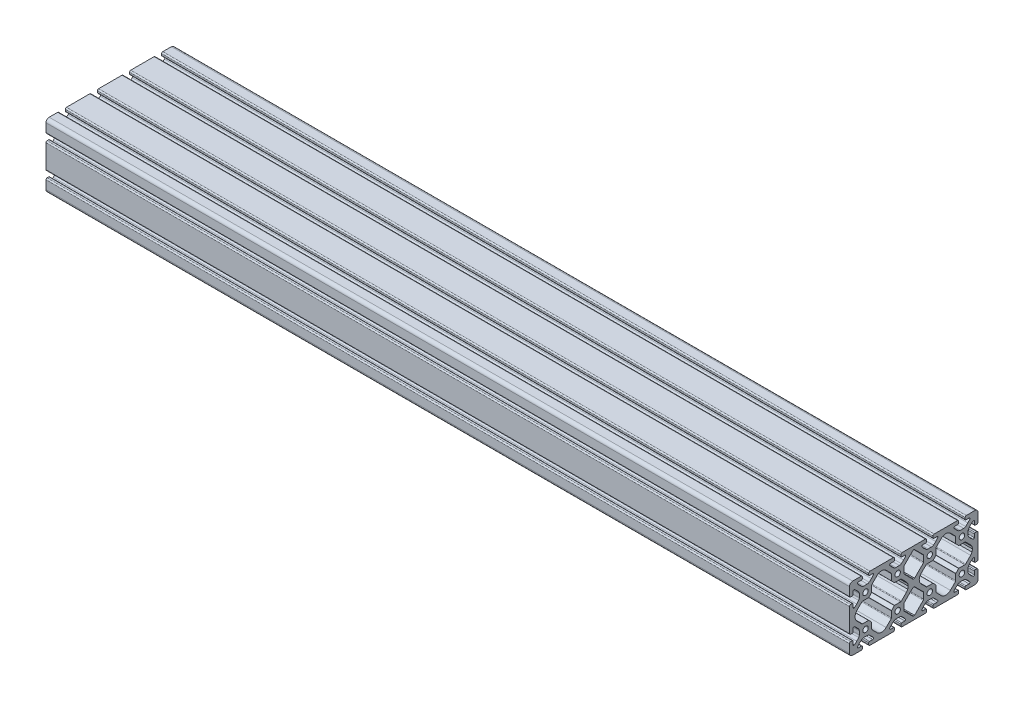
from build123d import *

# Parameters (mm, degrees)
MODEL_R                = 3.4
STRUKTURBAUTEIL1_DEPTH = 1000


with BuildPart() as part:
    # Model → Strukturbauteil1 (new body)
    with BuildSketch(Plane(origin=(0, 0, 0), x_dir=(0, 0, -1), z_dir=(1, 0, 0))):
        with BuildLine():
            Line((-73.773297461, 10.211192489), (-70.963551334, 12.621205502))
            Line((-70.963551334, 12.621205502), (-68.54047619, 15.419694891))
            ThreePointArc((-68.54047619, 15.419694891), (-67.952757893, 16.54958442), (-67.75, 17.806943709))
            Line((-67.75, 17.806943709), (-67.75, 22.193056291))
            ThreePointArc((-67.75, 22.193056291), (-67.952757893, 23.45041558), (-68.54047619, 24.580305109))
            Line((-68.54047619, 24.580305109), (-70.963551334, 27.378794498))
            Line((-70.963551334, 27.378794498), (-73.773297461, 29.788807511))
            ThreePointArc((-73.773297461, 29.788807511), (-74.905025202, 29.883468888), (-75.5, 28.91611505))
            Line((-75.5, 28.91611505), (-75.5, 25))
            ThreePointArc((-75.5, 25), (-75.792893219, 24.292893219), (-76.5, 24))
            Line((-76.5, 24), (-78.5, 24))
            ThreePointArc((-78.5, 24), (-79.560660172, 24.439339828), (-80, 25.5))
            Line((-80, 25.5), (-80, 36))
            ThreePointArc((-80, 36), (-78.828427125, 38.828427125), (-76, 40))
            Line((-76, 40), (-65.5, 40))
            ThreePointArc((-65.5, 40), (-64.439339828, 39.560660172), (-64, 38.5))
            Line((-64, 38.5), (-64, 36.5))
            ThreePointArc((-64, 36.5), (-64.292893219, 35.792893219), (-65, 35.5))
            Line((-65, 35.5), (-68.91611505, 35.5))
            ThreePointArc((-68.91611505, 35.5), (-69.883468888, 34.905025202), (-69.788807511, 33.773297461))
            Line((-69.788807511, 33.773297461), (-67.378794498, 30.963551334))
            Line((-67.378794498, 30.963551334), (-64.580305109, 28.54047619))
            ThreePointArc((-64.580305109, 28.54047619), (-63.45041558, 27.952757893), (-62.193056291, 27.75))
            Line((-62.193056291, 27.75), (-57.806943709, 27.75))
            ThreePointArc((-57.806943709, 27.75), (-56.54958442, 27.952757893), (-55.419694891, 28.54047619))
            Line((-55.419694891, 28.54047619), (-52.621205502, 30.963551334))
            Line((-52.621205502, 30.963551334), (-50.211192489, 33.773297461))
            ThreePointArc((-50.211192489, 33.773297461), (-50.116531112, 34.905025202), (-51.08388495, 35.5))
            Line((-51.08388495, 35.5), (-55, 35.5))
            ThreePointArc((-55, 35.5), (-55.707106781, 35.792893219), (-56, 36.5))
            Line((-56, 36.5), (-56, 38.5))
            ThreePointArc((-56, 38.5), (-55.560660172, 39.560660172), (-54.5, 40))
            Line((-54.5, 40), (-25.5, 40))
            ThreePointArc((-25.5, 40), (-24.439339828, 39.560660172), (-24, 38.5))
            Line((-24, 38.5), (-24, 36.5))
            ThreePointArc((-24, 36.5), (-24.292893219, 35.792893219), (-25, 35.5))
            Line((-25, 35.5), (-28.91611505, 35.5))
            ThreePointArc((-28.91611505, 35.5), (-29.883468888, 34.905025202), (-29.788807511, 33.773297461))
            Line((-29.788807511, 33.773297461), (-27.378794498, 30.963551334))
            Line((-27.378794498, 30.963551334), (-24.580305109, 28.54047619))
            ThreePointArc((-24.580305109, 28.54047619), (-23.45041558, 27.952757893), (-22.193056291, 27.75))
            Line((-22.193056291, 27.75), (-17.806943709, 27.75))
            ThreePointArc((-17.806943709, 27.75), (-16.54958442, 27.952757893), (-15.419694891, 28.54047619))
            Line((-15.419694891, 28.54047619), (-12.621205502, 30.963551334))
            Line((-12.621205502, 30.963551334), (-10.211192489, 33.773297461))
            ThreePointArc((-10.211192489, 33.773297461), (-10.116531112, 34.905025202), (-11.08388495, 35.5))
            Line((-11.08388495, 35.5), (-15, 35.5))
            ThreePointArc((-15, 35.5), (-15.707106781, 35.792893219), (-16, 36.5))
            Line((-16, 36.5), (-16, 38.5))
            ThreePointArc((-16, 38.5), (-15.560660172, 39.560660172), (-14.5, 40))
            Line((-14.5, 40), (14.5, 40))
            ThreePointArc((14.5, 40), (15.560660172, 39.560660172), (16, 38.5))
            Line((16, 38.5), (16, 36.5))
            ThreePointArc((16, 36.5), (15.707106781, 35.792893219), (15, 35.5))
            Line((15, 35.5), (11.08388495, 35.5))
            ThreePointArc((11.08388495, 35.5), (10.116531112, 34.905025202), (10.211192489, 33.773297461))
            Line((10.211192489, 33.773297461), (12.621205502, 30.963551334))
            Line((12.621205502, 30.963551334), (15.419694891, 28.54047619))
            ThreePointArc((15.419694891, 28.54047619), (16.54958442, 27.952757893), (17.806943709, 27.75))
            Line((17.806943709, 27.75), (22.193056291, 27.75))
            ThreePointArc((22.193056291, 27.75), (23.45041558, 27.952757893), (24.580305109, 28.54047619))
            Line((24.580305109, 28.54047619), (27.378794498, 30.963551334))
            Line((27.378794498, 30.963551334), (29.788807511, 33.773297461))
            ThreePointArc((29.788807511, 33.773297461), (29.883468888, 34.905025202), (28.91611505, 35.5))
            Line((28.91611505, 35.5), (25, 35.5))
            ThreePointArc((25, 35.5), (24.292893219, 35.792893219), (24, 36.5))
            Line((24, 36.5), (24, 38.5))
            ThreePointArc((24, 38.5), (24.439339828, 39.560660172), (25.5, 40))
            Line((25.5, 40), (54.5, 40))
            ThreePointArc((54.5, 40), (55.560660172, 39.560660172), (56, 38.5))
            Line((56, 38.5), (56, 36.5))
            ThreePointArc((56, 36.5), (55.707106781, 35.792893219), (55, 35.5))
            Line((55, 35.5), (51.08388495, 35.5))
            ThreePointArc((51.08388495, 35.5), (50.116531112, 34.905025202), (50.211192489, 33.773297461))
            Line((50.211192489, 33.773297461), (52.621205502, 30.963551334))
            Line((52.621205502, 30.963551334), (55.419694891, 28.54047619))
            ThreePointArc((55.419694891, 28.54047619), (56.54958442, 27.952757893), (57.806943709, 27.75))
            Line((57.806943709, 27.75), (62.193056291, 27.75))
            ThreePointArc((62.193056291, 27.75), (63.45041558, 27.952757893), (64.580305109, 28.54047619))
            Line((64.580305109, 28.54047619), (67.378794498, 30.963551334))
            Line((67.378794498, 30.963551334), (69.788807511, 33.773297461))
            ThreePointArc((69.788807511, 33.773297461), (69.883468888, 34.905025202), (68.91611505, 35.5))
            Line((68.91611505, 35.5), (65, 35.5))
            ThreePointArc((65, 35.5), (64.292893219, 35.792893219), (64, 36.5))
            Line((64, 36.5), (64, 38.5))
            ThreePointArc((64, 38.5), (64.439339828, 39.560660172), (65.5, 40))
            Line((65.5, 40), (76, 40))
            ThreePointArc((76, 40), (78.828427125, 38.828427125), (80, 36))
            Line((80, 36), (80, 25.5))
            ThreePointArc((80, 25.5), (79.560660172, 24.439339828), (78.5, 24))
            Line((78.5, 24), (76.5, 24))
            ThreePointArc((76.5, 24), (75.792893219, 24.292893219), (75.5, 25))
            Line((75.5, 25), (75.5, 28.91611505))
            ThreePointArc((75.5, 28.91611505), (74.905025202, 29.883468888), (73.773297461, 29.788807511))
            Line((73.773297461, 29.788807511), (70.963551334, 27.378794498))
            Line((70.963551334, 27.378794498), (68.54047619, 24.580305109))
            ThreePointArc((68.54047619, 24.580305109), (67.952757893, 23.45041558), (67.75, 22.193056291))
            Line((67.75, 22.193056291), (67.75, 17.806943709))
            ThreePointArc((67.75, 17.806943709), (67.952757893, 16.54958442), (68.54047619, 15.419694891))
            Line((68.54047619, 15.419694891), (70.963551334, 12.621205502))
            Line((70.963551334, 12.621205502), (73.773297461, 10.211192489))
            ThreePointArc((73.773297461, 10.211192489), (74.905025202, 10.116531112), (75.5, 11.08388495))
            Line((75.5, 11.08388495), (75.5, 15))
            ThreePointArc((75.5, 15), (75.792893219, 15.707106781), (76.5, 16))
            Line((76.5, 16), (78.5, 16))
            ThreePointArc((78.5, 16), (79.560660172, 15.560660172), (80, 14.5))
            Line((80, 14.5), (80, -14.5))
            ThreePointArc((80, -14.5), (79.560660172, -15.560660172), (78.5, -16))
            Line((78.5, -16), (76.5, -16))
            ThreePointArc((76.5, -16), (75.792893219, -15.707106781), (75.5, -15))
            Line((75.5, -15), (75.5, -11.08388495))
            ThreePointArc((75.5, -11.08388495), (74.905025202, -10.116531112), (73.773297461, -10.211192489))
            Line((73.773297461, -10.211192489), (70.963551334, -12.621205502))
            Line((70.963551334, -12.621205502), (68.54047619, -15.419694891))
            ThreePointArc((68.54047619, -15.419694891), (67.952757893, -16.54958442), (67.75, -17.806943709))
            Line((67.75, -17.806943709), (67.75, -22.193056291))
            ThreePointArc((67.75, -22.193056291), (67.952757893, -23.45041558), (68.54047619, -24.580305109))
            Line((68.54047619, -24.580305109), (70.963551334, -27.378794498))
            Line((70.963551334, -27.378794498), (73.773297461, -29.788807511))
            ThreePointArc((73.773297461, -29.788807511), (74.905025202, -29.883468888), (75.5, -28.91611505))
            Line((75.5, -28.91611505), (75.5, -25))
            ThreePointArc((75.5, -25), (75.792893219, -24.292893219), (76.5, -24))
            Line((76.5, -24), (78.5, -24))
            ThreePointArc((78.5, -24), (79.560660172, -24.439339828), (80, -25.5))
            Line((80, -25.5), (80, -36))
            ThreePointArc((80, -36), (78.828427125, -38.828427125), (76, -40))
            Line((76, -40), (65.5, -40))
            ThreePointArc((65.5, -40), (64.439339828, -39.560660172), (64, -38.5))
            Line((64, -38.5), (64, -36.5))
            ThreePointArc((64, -36.5), (64.292893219, -35.792893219), (65, -35.5))
            Line((65, -35.5), (68.91611505, -35.5))
            ThreePointArc((68.91611505, -35.5), (69.883468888, -34.905025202), (69.788807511, -33.773297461))
            Line((69.788807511, -33.773297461), (67.378794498, -30.963551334))
            Line((67.378794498, -30.963551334), (64.580305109, -28.54047619))
            ThreePointArc((64.580305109, -28.54047619), (63.45041558, -27.952757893), (62.193056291, -27.75))
            Line((62.193056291, -27.75), (57.806943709, -27.75))
            ThreePointArc((57.806943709, -27.75), (56.54958442, -27.952757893), (55.419694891, -28.54047619))
            Line((55.419694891, -28.54047619), (52.621205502, -30.963551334))
            Line((52.621205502, -30.963551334), (50.211192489, -33.773297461))
            ThreePointArc((50.211192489, -33.773297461), (50.116531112, -34.905025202), (51.08388495, -35.5))
            Line((51.08388495, -35.5), (55, -35.5))
            ThreePointArc((55, -35.5), (55.707106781, -35.792893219), (56, -36.5))
            Line((56, -36.5), (56, -38.5))
            ThreePointArc((56, -38.5), (55.560660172, -39.560660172), (54.5, -40))
            Line((54.5, -40), (25.5, -40))
            ThreePointArc((25.5, -40), (24.439339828, -39.560660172), (24, -38.5))
            Line((24, -38.5), (24, -36.5))
            ThreePointArc((24, -36.5), (24.292893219, -35.792893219), (25, -35.5))
            Line((25, -35.5), (28.91611505, -35.5))
            ThreePointArc((28.91611505, -35.5), (29.883468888, -34.905025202), (29.788807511, -33.773297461))
            Line((29.788807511, -33.773297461), (27.378794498, -30.963551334))
            Line((27.378794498, -30.963551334), (24.580305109, -28.54047619))
            ThreePointArc((24.580305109, -28.54047619), (23.45041558, -27.952757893), (22.193056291, -27.75))
            Line((22.193056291, -27.75), (17.806943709, -27.75))
            ThreePointArc((17.806943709, -27.75), (16.54958442, -27.952757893), (15.419694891, -28.54047619))
            Line((15.419694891, -28.54047619), (12.621205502, -30.963551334))
            Line((12.621205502, -30.963551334), (10.211192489, -33.773297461))
            ThreePointArc((10.211192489, -33.773297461), (10.116531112, -34.905025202), (11.08388495, -35.5))
            Line((11.08388495, -35.5), (15, -35.5))
            ThreePointArc((15, -35.5), (15.707106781, -35.792893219), (16, -36.5))
            Line((16, -36.5), (16, -38.5))
            ThreePointArc((16, -38.5), (15.560660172, -39.560660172), (14.5, -40))
            Line((14.5, -40), (-14.5, -40))
            ThreePointArc((-14.5, -40), (-15.560660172, -39.560660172), (-16, -38.5))
            Line((-16, -38.5), (-16, -36.5))
            ThreePointArc((-16, -36.5), (-15.707106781, -35.792893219), (-15, -35.5))
            Line((-15, -35.5), (-11.08388495, -35.5))
            ThreePointArc((-11.08388495, -35.5), (-10.116531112, -34.905025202), (-10.211192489, -33.773297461))
            Line((-10.211192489, -33.773297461), (-12.621205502, -30.963551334))
            Line((-12.621205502, -30.963551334), (-15.419694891, -28.54047619))
            ThreePointArc((-15.419694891, -28.54047619), (-16.54958442, -27.952757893), (-17.806943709, -27.75))
            Line((-17.806943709, -27.75), (-22.193056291, -27.75))
            ThreePointArc((-22.193056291, -27.75), (-23.45041558, -27.952757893), (-24.580305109, -28.54047619))
            Line((-24.580305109, -28.54047619), (-27.378794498, -30.963551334))
            Line((-27.378794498, -30.963551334), (-29.788807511, -33.773297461))
            ThreePointArc((-29.788807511, -33.773297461), (-29.883468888, -34.905025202), (-28.91611505, -35.5))
            Line((-28.91611505, -35.5), (-25, -35.5))
            ThreePointArc((-25, -35.5), (-24.292893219, -35.792893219), (-24, -36.5))
            Line((-24, -36.5), (-24, -38.5))
            ThreePointArc((-24, -38.5), (-24.439339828, -39.560660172), (-25.5, -40))
            Line((-25.5, -40), (-54.5, -40))
            ThreePointArc((-54.5, -40), (-55.560660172, -39.560660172), (-56, -38.5))
            Line((-56, -38.5), (-56, -36.5))
            ThreePointArc((-56, -36.5), (-55.707106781, -35.792893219), (-55, -35.5))
            Line((-55, -35.5), (-51.08388495, -35.5))
            ThreePointArc((-51.08388495, -35.5), (-50.116531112, -34.905025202), (-50.211192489, -33.773297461))
            Line((-50.211192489, -33.773297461), (-52.621205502, -30.963551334))
            Line((-52.621205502, -30.963551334), (-55.419694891, -28.54047619))
            ThreePointArc((-55.419694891, -28.54047619), (-56.54958442, -27.952757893), (-57.806943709, -27.75))
            Line((-57.806943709, -27.75), (-62.193056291, -27.75))
            ThreePointArc((-62.193056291, -27.75), (-63.45041558, -27.952757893), (-64.580305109, -28.54047619))
            Line((-64.580305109, -28.54047619), (-67.378794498, -30.963551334))
            Line((-67.378794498, -30.963551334), (-69.788807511, -33.773297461))
            ThreePointArc((-69.788807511, -33.773297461), (-69.883468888, -34.905025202), (-68.91611505, -35.5))
            Line((-68.91611505, -35.5), (-65, -35.5))
            ThreePointArc((-65, -35.5), (-64.292893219, -35.792893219), (-64, -36.5))
            Line((-64, -36.5), (-64, -38.5))
            ThreePointArc((-64, -38.5), (-64.439339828, -39.560660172), (-65.5, -40))
            Line((-65.5, -40), (-76, -40))
            ThreePointArc((-76, -40), (-78.828427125, -38.828427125), (-80, -36))
            Line((-80, -36), (-80, -25.5))
            ThreePointArc((-80, -25.5), (-79.560660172, -24.439339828), (-78.5, -24))
            Line((-78.5, -24), (-76.5, -24))
            ThreePointArc((-76.5, -24), (-75.792893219, -24.292893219), (-75.5, -25))
            Line((-75.5, -25), (-75.5, -28.91611505))
            ThreePointArc((-75.5, -28.91611505), (-74.905025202, -29.883468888), (-73.773297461, -29.788807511))
            Line((-73.773297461, -29.788807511), (-70.963551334, -27.378794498))
            Line((-70.963551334, -27.378794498), (-68.54047619, -24.580305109))
            ThreePointArc((-68.54047619, -24.580305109), (-67.952757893, -23.45041558), (-67.75, -22.193056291))
            Line((-67.75, -22.193056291), (-67.75, -17.806943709))
            ThreePointArc((-67.75, -17.806943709), (-67.952757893, -16.54958442), (-68.54047619, -15.419694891))
            Line((-68.54047619, -15.419694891), (-70.963551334, -12.621205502))
            Line((-70.963551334, -12.621205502), (-73.773297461, -10.211192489))
            ThreePointArc((-73.773297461, -10.211192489), (-74.905025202, -10.116531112), (-75.5, -11.08388495))
            Line((-75.5, -11.08388495), (-75.5, -15))
            ThreePointArc((-75.5, -15), (-75.792893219, -15.707106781), (-76.5, -16))
            Line((-76.5, -16), (-78.5, -16))
            ThreePointArc((-78.5, -16), (-79.560660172, -15.560660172), (-80, -14.5))
            Line((-80, -14.5), (-80, 14.5))
            ThreePointArc((-80, 14.5), (-79.560660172, 15.560660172), (-78.5, 16))
            Line((-78.5, 16), (-76.5, 16))
            ThreePointArc((-76.5, 16), (-75.792893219, 15.707106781), (-75.5, 15))
            Line((-75.5, 15), (-75.5, 11.08388495))
            ThreePointArc((-75.5, 11.08388495), (-74.905025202, 10.116531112), (-73.773297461, 10.211192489))
        make_face()
        with Locations((-60, 20)):
            Circle(MODEL_R, mode=Mode.SUBTRACT)
        with Locations((-20, 20)):
            Circle(MODEL_R, mode=Mode.SUBTRACT)
        with Locations((20, 20)):
            Circle(MODEL_R, mode=Mode.SUBTRACT)
        with Locations((60, 20)):
            Circle(MODEL_R, mode=Mode.SUBTRACT)
        with Locations((60, -20)):
            Circle(MODEL_R, mode=Mode.SUBTRACT)
        with Locations((20, -20)):
            Circle(MODEL_R, mode=Mode.SUBTRACT)
        with Locations((-20, -20)):
            Circle(MODEL_R, mode=Mode.SUBTRACT)
        with Locations((-60, -20)):
            Circle(MODEL_R, mode=Mode.SUBTRACT)
        with BuildLine():
            Line((-11.810660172, 24.653805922), (-1.060660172, 35.403805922))
            Line((-1.060660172, 35.403805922), (0, 35.843145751))
            Line((0, 35.843145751), (1.060660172, 35.403805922))
            Line((1.060660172, 35.403805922), (11.810660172, 24.653805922))
            ThreePointArc((11.810660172, 24.653805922), (12.135819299, 24.167170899), (12.25, 23.593145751))
            Line((12.25, 23.593145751), (12.25, 16.406854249))
            ThreePointArc((12.25, 16.406854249), (12.135819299, 15.832829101), (11.810660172, 15.346194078))
            Line((11.810660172, 15.346194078), (1.060660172, 4.596194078))
            Line((1.060660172, 4.596194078), (0, 4.156854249))
            Line((0, 4.156854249), (-1.060660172, 4.596194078))
            Line((-1.060660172, 4.596194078), (-11.810660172, 15.346194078))
            ThreePointArc((-11.810660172, 15.346194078), (-12.135819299, 15.832829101), (-12.25, 16.406854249))
            Line((-12.25, 16.406854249), (-12.25, 23.593145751))
            ThreePointArc((-12.25, 23.593145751), (-12.135819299, 24.167170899), (-11.810660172, 24.653805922))
        make_face(mode=Mode.SUBTRACT)
        with BuildLine():
            Line((-9.192388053, 5.656854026), (-7.458206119, 3.061467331))
            Line((-7.458206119, 3.061467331), (-6.849242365, 0))
            Line((-6.849242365, 0), (-7.458206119, -3.061467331))
            Line((-7.458206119, -3.061467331), (-9.192388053, -5.656854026))
            Line((-9.192388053, -5.656854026), (-15.34619405, -11.81066016))
            ThreePointArc((-15.34619405, -11.81066016), (-15.832829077, -12.135819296), (-16.406854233, -12.25))
            Line((-16.406854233, -12.25), (-23.758621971, -12.25))
            ThreePointArc((-23.758621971, -12.25), (-23.949963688, -12.288060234), (-24.112175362, -12.396446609))
            Line((-24.112175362, -12.396446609), (-27.603553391, -15.887824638))
            ThreePointArc((-27.603553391, -15.887824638), (-27.711939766, -16.050036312), (-27.75, -16.241378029))
            Line((-27.75, -16.241378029), (-27.75, -23.593145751))
            ThreePointArc((-27.75, -23.593145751), (-27.864180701, -24.167170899), (-28.189339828, -24.653805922))
            Line((-28.189339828, -24.653805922), (-34.343145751, -30.807611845))
            ThreePointArc((-34.343145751, -30.807611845), (-40, -33.150757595), (-45.656854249, -30.807611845))
            Line((-45.656854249, -30.807611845), (-51.810660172, -24.653805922))
            ThreePointArc((-51.810660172, -24.653805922), (-52.135819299, -24.167170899), (-52.25, -23.593145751))
            Line((-52.25, -23.593145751), (-52.25, -16.241378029))
            ThreePointArc((-52.25, -16.241378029), (-52.288060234, -16.050036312), (-52.396446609, -15.887824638))
            Line((-52.396446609, -15.887824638), (-55.887824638, -12.396446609))
            ThreePointArc((-55.887824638, -12.396446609), (-56.050036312, -12.288060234), (-56.241378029, -12.25))
            Line((-56.241378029, -12.25), (-63.593145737, -12.25))
            ThreePointArc((-63.593145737, -12.25), (-64.167170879, -12.135819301), (-64.653805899, -11.810660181))
            Line((-64.653805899, -11.810660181), (-70.807611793, -5.6568544))
            Line((-70.807611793, -5.6568544), (-72.54179386, -3.061467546))
            Line((-72.54179386, -3.061467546), (-73.150757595, 0))
            Line((-73.150757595, 0), (-72.54179386, 3.061467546))
            Line((-72.54179386, 3.061467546), (-70.807611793, 5.6568544))
            Line((-70.807611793, 5.6568544), (-64.653805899, 11.810660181))
            ThreePointArc((-64.653805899, 11.810660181), (-64.167170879, 12.135819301), (-63.593145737, 12.25))
            Line((-63.593145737, 12.25), (-56.241378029, 12.25))
            ThreePointArc((-56.241378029, 12.25), (-56.050036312, 12.288060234), (-55.887824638, 12.396446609))
            Line((-55.887824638, 12.396446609), (-52.396446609, 15.887824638))
            ThreePointArc((-52.396446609, 15.887824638), (-52.288060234, 16.050036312), (-52.25, 16.241378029))
            Line((-52.25, 16.241378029), (-52.25, 23.593145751))
            ThreePointArc((-52.25, 23.593145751), (-52.135819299, 24.167170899), (-51.810660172, 24.653805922))
            Line((-51.810660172, 24.653805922), (-45.656854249, 30.807611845))
            ThreePointArc((-45.656854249, 30.807611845), (-40, 33.150757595), (-34.343145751, 30.807611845))
            Line((-34.343145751, 30.807611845), (-28.189339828, 24.653805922))
            ThreePointArc((-28.189339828, 24.653805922), (-27.864180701, 24.167170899), (-27.75, 23.593145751))
            Line((-27.75, 23.593145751), (-27.75, 16.241378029))
            ThreePointArc((-27.75, 16.241378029), (-27.711939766, 16.050036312), (-27.603553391, 15.887824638))
            Line((-27.603553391, 15.887824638), (-24.112175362, 12.396446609))
            ThreePointArc((-24.112175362, 12.396446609), (-23.949963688, 12.288060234), (-23.758621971, 12.25))
            Line((-23.758621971, 12.25), (-16.406854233, 12.25))
            ThreePointArc((-16.406854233, 12.25), (-15.832829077, 12.135819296), (-15.34619405, 11.81066016))
            Line((-15.34619405, 11.81066016), (-9.192388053, 5.656854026))
        make_face(mode=Mode.SUBTRACT)
        with BuildLine():
            Line((52.25, 23.593145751), (52.25, 16.241378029))
            ThreePointArc((52.25, 16.241378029), (52.288060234, 16.050036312), (52.396446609, 15.887824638))
            Line((52.396446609, 15.887824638), (55.887824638, 12.396446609))
            ThreePointArc((55.887824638, 12.396446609), (56.050036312, 12.288060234), (56.241378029, 12.25))
            Line((56.241378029, 12.25), (63.593145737, 12.25))
            ThreePointArc((63.593145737, 12.25), (64.167170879, 12.135819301), (64.653805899, 11.810660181))
            Line((64.653805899, 11.810660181), (70.807611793, 5.6568544))
            Line((70.807611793, 5.6568544), (72.54179386, 3.061467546))
            Line((72.54179386, 3.061467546), (73.150757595, 0))
            Line((73.150757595, 0), (72.54179386, -3.061467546))
            Line((72.54179386, -3.061467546), (70.807611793, -5.6568544))
            Line((70.807611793, -5.6568544), (64.653805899, -11.810660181))
            ThreePointArc((64.653805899, -11.810660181), (64.167170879, -12.135819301), (63.593145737, -12.25))
            Line((63.593145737, -12.25), (56.241378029, -12.25))
            ThreePointArc((56.241378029, -12.25), (56.050036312, -12.288060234), (55.887824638, -12.396446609))
            Line((55.887824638, -12.396446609), (52.396446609, -15.887824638))
            ThreePointArc((52.396446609, -15.887824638), (52.288060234, -16.050036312), (52.25, -16.241378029))
            Line((52.25, -16.241378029), (52.25, -23.593145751))
            ThreePointArc((52.25, -23.593145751), (52.135819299, -24.167170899), (51.810660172, -24.653805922))
            Line((51.810660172, -24.653805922), (45.656854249, -30.807611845))
            ThreePointArc((45.656854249, -30.807611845), (40, -33.150757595), (34.343145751, -30.807611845))
            Line((34.343145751, -30.807611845), (28.189339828, -24.653805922))
            ThreePointArc((28.189339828, -24.653805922), (27.864180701, -24.167170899), (27.75, -23.593145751))
            Line((27.75, -23.593145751), (27.75, -16.241378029))
            ThreePointArc((27.75, -16.241378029), (27.711939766, -16.050036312), (27.603553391, -15.887824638))
            Line((27.603553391, -15.887824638), (24.112175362, -12.396446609))
            ThreePointArc((24.112175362, -12.396446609), (23.949963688, -12.288060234), (23.758621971, -12.25))
            Line((23.758621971, -12.25), (16.406854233, -12.25))
            ThreePointArc((16.406854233, -12.25), (15.832829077, -12.135819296), (15.34619405, -11.81066016))
            Line((15.34619405, -11.81066016), (9.192388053, -5.656854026))
            Line((9.192388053, -5.656854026), (7.458206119, -3.061467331))
            Line((7.458206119, -3.061467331), (6.849242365, 0))
            Line((6.849242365, 0), (7.458206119, 3.061467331))
            Line((7.458206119, 3.061467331), (9.192388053, 5.656854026))
            Line((9.192388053, 5.656854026), (15.34619405, 11.81066016))
            ThreePointArc((15.34619405, 11.81066016), (15.832829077, 12.135819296), (16.406854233, 12.25))
            Line((16.406854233, 12.25), (23.758621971, 12.25))
            ThreePointArc((23.758621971, 12.25), (23.949963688, 12.288060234), (24.112175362, 12.396446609))
            Line((24.112175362, 12.396446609), (27.603553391, 15.887824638))
            ThreePointArc((27.603553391, 15.887824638), (27.711939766, 16.050036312), (27.75, 16.241378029))
            Line((27.75, 16.241378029), (27.75, 23.593145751))
            ThreePointArc((27.75, 23.593145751), (27.864180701, 24.167170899), (28.189339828, 24.653805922))
            Line((28.189339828, 24.653805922), (34.343145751, 30.807611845))
            ThreePointArc((34.343145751, 30.807611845), (40, 33.150757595), (45.656854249, 30.807611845))
            Line((45.656854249, 30.807611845), (51.810660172, 24.653805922))
            ThreePointArc((51.810660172, 24.653805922), (52.135819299, 24.167170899), (52.25, 23.593145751))
        make_face(mode=Mode.SUBTRACT)
        with BuildLine():
            Line((11.810660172, -24.653805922), (1.060660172, -35.403805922))
            Line((1.060660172, -35.403805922), (0, -35.843145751))
            Line((0, -35.843145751), (-1.060660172, -35.403805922))
            Line((-1.060660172, -35.403805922), (-11.810660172, -24.653805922))
            ThreePointArc((-11.810660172, -24.653805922), (-12.135819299, -24.167170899), (-12.25, -23.593145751))
            Line((-12.25, -23.593145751), (-12.25, -16.406854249))
            ThreePointArc((-12.25, -16.406854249), (-12.135819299, -15.832829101), (-11.810660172, -15.346194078))
            Line((-11.810660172, -15.346194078), (-1.060660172, -4.596194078))
            Line((-1.060660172, -4.596194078), (0, -4.156854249))
            Line((0, -4.156854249), (1.060660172, -4.596194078))
            Line((1.060660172, -4.596194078), (11.810660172, -15.346194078))
            ThreePointArc((11.810660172, -15.346194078), (12.135819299, -15.832829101), (12.25, -16.406854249))
            Line((12.25, -16.406854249), (12.25, -23.593145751))
            ThreePointArc((12.25, -23.593145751), (12.135819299, -24.167170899), (11.810660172, -24.653805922))
        make_face(mode=Mode.SUBTRACT)
    extrude(amount=STRUKTURBAUTEIL1_DEPTH)


solid = part.part
